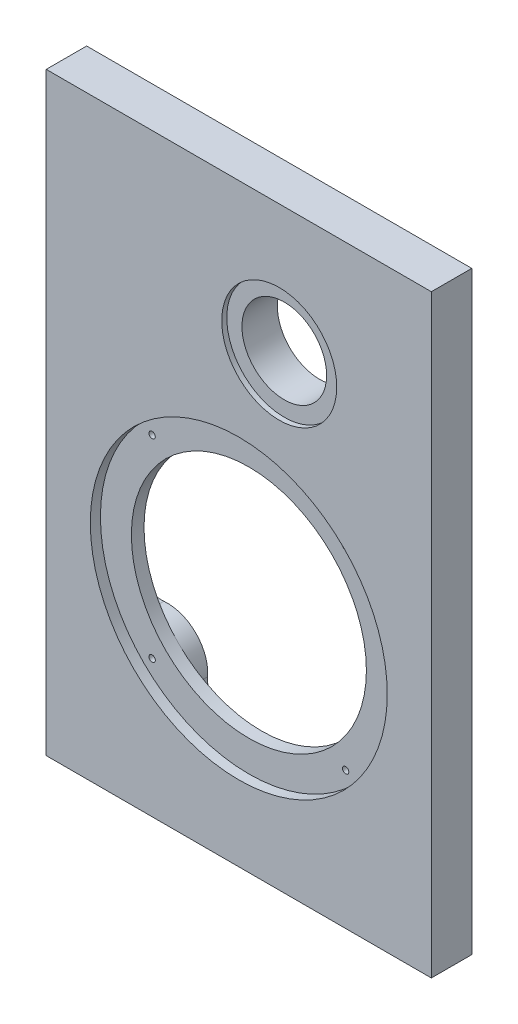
from build123d import *

# Parameters (mm, degrees)
SKETCH1_W           = 152.4
SKETCH1_H           = 235.2
SKETCH1_R           = 46.5
SKETCH1_R_2         = 16.75
BOSS_EXTRUDE1_DEPTH = 16
SKETCH2_R           = 22.75
CUT_EXTRUDE1_DEPTH  = 2
SKETCH5_R           = 58.75
CUT_EXTRUDE3_DEPTH  = 4
SKETCH6_R           = 1.25
CUT_EXTRUDE4_DEPTH  = 5
CUT_EXTRUDE5_DEPTH  = 7
FILLET1_R           = 10


with BuildPart() as part:
    # Sketch1 → Boss-Extrude1 (new body)
    with BuildSketch(Plane.XY):
        Rectangle(SKETCH1_W, SKETCH1_H)
        with Locations((0, -29.05)):
            Circle(SKETCH1_R, mode=Mode.SUBTRACT)
        with Locations((16, 66.2)):
            Circle(SKETCH1_R_2, mode=Mode.SUBTRACT)
    extrude(amount=BOSS_EXTRUDE1_DEPTH)

    # Sketch2 → Cut-Extrude1 (cut)
    with BuildSketch(Plane.XY.offset(16)):
        with Locations((16, 66.2)):
            Circle(SKETCH2_R)
    extrude(amount=-CUT_EXTRUDE1_DEPTH, mode=Mode.SUBTRACT)

    # Sketch5 → Cut-Extrude3 (cut)
    with BuildSketch(Plane.XY.offset(16)):
        with Locations((0, -29.05)):
            Circle(SKETCH5_R)
    extrude(amount=-CUT_EXTRUDE3_DEPTH, mode=Mode.SUBTRACT)

    # Sketch6 → Cut-Extrude4 (cut)
    with BuildSketch(Plane.XY.offset(12)):
        with Locations((-38.289832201, 9.239832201)):
            Circle(SKETCH6_R)
        with Locations((-38.289832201, -67.339832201)):
            Circle(SKETCH6_R)
        with Locations(Location((38.289832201, -67.339832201, 0), (0, 0, 180))):
            Circle(SKETCH6_R)
        with Locations(Location((38.289832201, 9.239832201, 0), (0, 0, 180))):
            Circle(SKETCH6_R)
    extrude(amount=-CUT_EXTRUDE4_DEPTH, mode=Mode.SUBTRACT)

    # Sketch7 → Cut-Extrude5 (cut)
    with BuildSketch(Plane(origin=(0, 0, 0), x_dir=(-1, 0, 0), z_dir=(0, 0, -1))):
        with BuildLine():
            ThreePointArc((-51.843919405, 1.152781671), (-59.999999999, -29.050339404), (-51.843577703, -59.253368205))
            ThreePointArc((-51.843577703, -59.253368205), (-32.969021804, -62.019021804), (-30.203368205, -80.893577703))
            ThreePointArc((-30.203368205, -80.893577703), (0, -89.05), (30.203368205, -80.893577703))
            ThreePointArc((30.203368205, -80.893577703), (32.969021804, -62.019021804), (51.843577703, -59.253368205))
            ThreePointArc((51.843577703, -59.253368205), (59.999999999, -29.050339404), (51.843919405, 1.152781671))
            ThreePointArc((51.843919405, 1.152781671), (32.968542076, 3.918542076), (30.202781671, 22.793919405))
            ThreePointArc((30.202781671, 22.793919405), (0, 30.95), (-30.202781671, 22.793919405))
            ThreePointArc((-30.202781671, 22.793919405), (-32.968542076, 3.918542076), (-51.843919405, 1.152781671))
        make_face()
    extrude(amount=-CUT_EXTRUDE5_DEPTH, mode=Mode.SUBTRACT)

    # Fillet1
    fillet1_edges = [part.edges().sort_by_distance(p)[0] for p in [
        (-51.843577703, -59.253368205, 3.5),
        (-51.843919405, 1.152781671, 3.5),
        (-30.202781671, 22.793919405, 3.5),
        (30.202781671, 22.793919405, 3.5),
        (51.843919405, 1.152781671, 3.5),
        (51.843577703, -59.253368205, 3.5),
        (30.203368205, -80.893577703, 3.5),
        (-30.203368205, -80.893577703, 3.5),
    ]]
    fillet(fillet1_edges, radius=FILLET1_R)


solid = part.part
